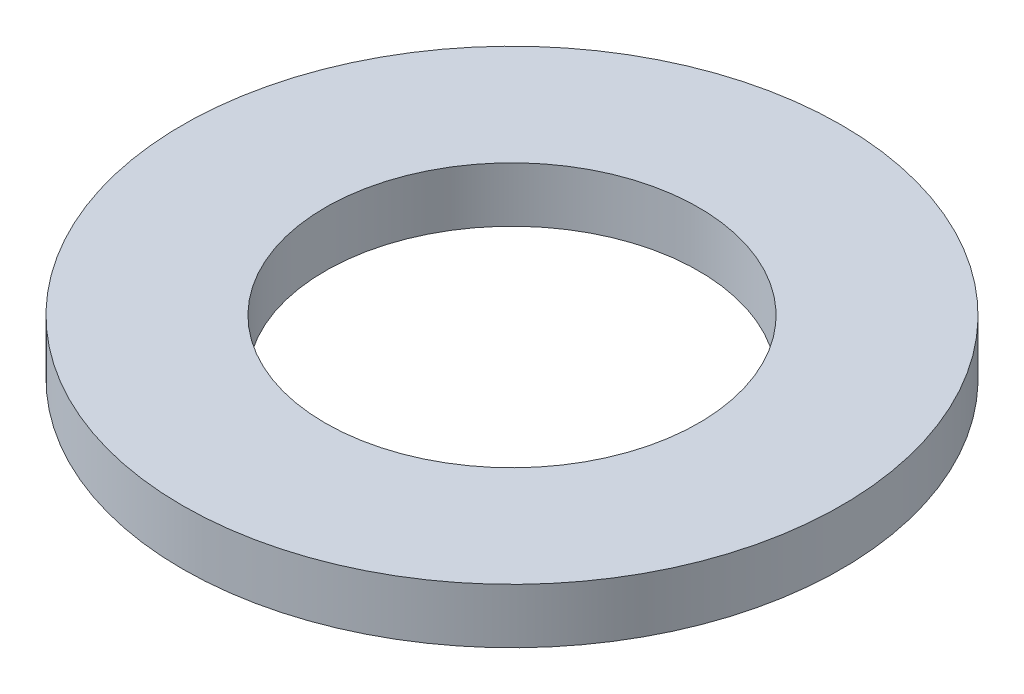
ISO-10303-21;
HEADER;
FILE_DESCRIPTION(('STEP AP214'),'2;1');
FILE_NAME('part.step','',(''),(''),'','','');
FILE_SCHEMA(('AUTOMOTIVE_DESIGN { 1 0 10303 214 1 1 1 1 }'));
ENDSEC;
DATA;
#1=APPLICATION_CONTEXT('core data for automotive mechanical design processes');
#2=APPLICATION_PROTOCOL_DEFINITION('international standard','automotive_design',2000,#1);
#3=PRODUCT_CONTEXT('',#1,'mechanical');
#4=PRODUCT('Part','Part','',(#3));
#5=PRODUCT_RELATED_PRODUCT_CATEGORY('part','',(#4));
#6=PRODUCT_DEFINITION_FORMATION('','',#4);
#7=PRODUCT_DEFINITION_CONTEXT('part definition',#1,'design');
#8=PRODUCT_DEFINITION('design','',#6,#7);
#9=PRODUCT_DEFINITION_SHAPE('','',#8);
#10=(LENGTH_UNIT() NAMED_UNIT(*) SI_UNIT(.MILLI.,.METRE.));
#11=(NAMED_UNIT(*) PLANE_ANGLE_UNIT() SI_UNIT($,.RADIAN.));
#12=(NAMED_UNIT(*) SI_UNIT($,.STERADIAN.) SOLID_ANGLE_UNIT());
#13=UNCERTAINTY_MEASURE_WITH_UNIT(LENGTH_MEASURE(1.E-05),#10,'distance_accuracy_value','');
#14=(GEOMETRIC_REPRESENTATION_CONTEXT(3) GLOBAL_UNCERTAINTY_ASSIGNED_CONTEXT((#13)) GLOBAL_UNIT_ASSIGNED_CONTEXT((#10,
#11,#12)) REPRESENTATION_CONTEXT('',''));
#15=CARTESIAN_POINT('',(0.,0.,0.));
#16=DIRECTION('',(0.,0.,1.));
#17=DIRECTION('',(1.,0.,0.));
#18=AXIS2_PLACEMENT_3D('',#15,#16,#17);
#19=CARTESIAN_POINT('',(0.,5.,0.));
#20=DIRECTION('',(0.,1.,0.));
#21=DIRECTION('',(0.,0.,1.));
#22=AXIS2_PLACEMENT_3D('',#19,#20,#21);
#23=PLANE('',#22);
#24=CARTESIAN_POINT('',(0.,5.,0.));
#25=DIRECTION('',(0.,1.,0.));
#26=DIRECTION('',(0.,0.,1.));
#27=AXIS2_PLACEMENT_3D('',#24,#25,#26);
#28=CIRCLE('',#27,30.);
#29=CARTESIAN_POINT('',(0.,5.,30.));
#30=VERTEX_POINT('',#29);
#31=EDGE_CURVE('E10',#30,#30,#28,.T.);
#32=ORIENTED_EDGE('',*,*,#31,.T.);
#33=EDGE_LOOP('',(#32));
#34=FACE_BOUND('',#33,.T.);
#35=CARTESIAN_POINT('',(0.,5.,0.));
#36=DIRECTION('',(0.,1.,0.));
#37=DIRECTION('',(0.,0.,1.));
#38=AXIS2_PLACEMENT_3D('',#35,#36,#37);
#39=CIRCLE('',#38,17.);
#40=CARTESIAN_POINT('',(0.,5.,17.));
#41=VERTEX_POINT('',#40);
#42=EDGE_CURVE('E39',#41,#41,#39,.T.);
#43=ORIENTED_EDGE('',*,*,#42,.F.);
#44=EDGE_LOOP('',(#43));
#45=FACE_BOUND('',#44,.T.);
#46=ADVANCED_FACE('F28',(#34,#45),#23,.T.);
#47=CARTESIAN_POINT('',(0.,0.,0.));
#48=DIRECTION('',(0.,1.,0.));
#49=DIRECTION('',(0.,0.,1.));
#50=AXIS2_PLACEMENT_3D('',#47,#48,#49);
#51=PLANE('',#50);
#52=CARTESIAN_POINT('',(0.,0.,0.));
#53=DIRECTION('',(0.,1.,0.));
#54=DIRECTION('',(0.,0.,1.));
#55=AXIS2_PLACEMENT_3D('',#52,#53,#54);
#56=CIRCLE('',#55,30.);
#57=CARTESIAN_POINT('',(0.,0.,30.));
#58=VERTEX_POINT('',#57);
#59=EDGE_CURVE('E35',#58,#58,#56,.T.);
#60=ORIENTED_EDGE('',*,*,#59,.F.);
#61=EDGE_LOOP('',(#60));
#62=FACE_BOUND('',#61,.T.);
#63=CARTESIAN_POINT('',(0.,0.,0.));
#64=DIRECTION('',(0.,1.,0.));
#65=DIRECTION('',(0.,0.,1.));
#66=AXIS2_PLACEMENT_3D('',#63,#64,#65);
#67=CIRCLE('',#66,17.);
#68=CARTESIAN_POINT('',(0.,0.,17.));
#69=VERTEX_POINT('',#68);
#70=EDGE_CURVE('E43',#69,#69,#67,.T.);
#71=ORIENTED_EDGE('',*,*,#70,.T.);
#72=EDGE_LOOP('',(#71));
#73=FACE_BOUND('',#72,.T.);
#74=ADVANCED_FACE('F49',(#62,#73),#51,.F.);
#75=CARTESIAN_POINT('',(0.,5.,0.));
#76=DIRECTION('',(0.,-1.,0.));
#77=DIRECTION('',(0.,0.,-1.));
#78=AXIS2_PLACEMENT_3D('',#75,#76,#77);
#79=CYLINDRICAL_SURFACE('',#78,30.);
#80=ORIENTED_EDGE('',*,*,#31,.F.);
#81=EDGE_LOOP('',(#80));
#82=FACE_BOUND('',#81,.T.);
#83=ORIENTED_EDGE('',*,*,#59,.T.);
#84=EDGE_LOOP('',(#83));
#85=FACE_BOUND('',#84,.T.);
#86=ADVANCED_FACE('F30',(#82,#85),#79,.T.);
#87=CARTESIAN_POINT('',(0.,5.,0.));
#88=DIRECTION('',(0.,-1.,0.));
#89=DIRECTION('',(0.,0.,-1.));
#90=AXIS2_PLACEMENT_3D('',#87,#88,#89);
#91=CYLINDRICAL_SURFACE('',#90,17.);
#92=ORIENTED_EDGE('',*,*,#42,.T.);
#93=EDGE_LOOP('',(#92));
#94=FACE_BOUND('',#93,.T.);
#95=ORIENTED_EDGE('',*,*,#70,.F.);
#96=EDGE_LOOP('',(#95));
#97=FACE_BOUND('',#96,.T.);
#98=ADVANCED_FACE('F51',(#94,#97),#91,.F.);
#99=CLOSED_SHELL('',(#46,#74,#86,#98));
#100=MANIFOLD_SOLID_BREP('B2',#99);
#101=ADVANCED_BREP_SHAPE_REPRESENTATION('',(#18,#100),#14);
#102=SHAPE_DEFINITION_REPRESENTATION(#9,#101);
ENDSEC;
END-ISO-10303-21;
